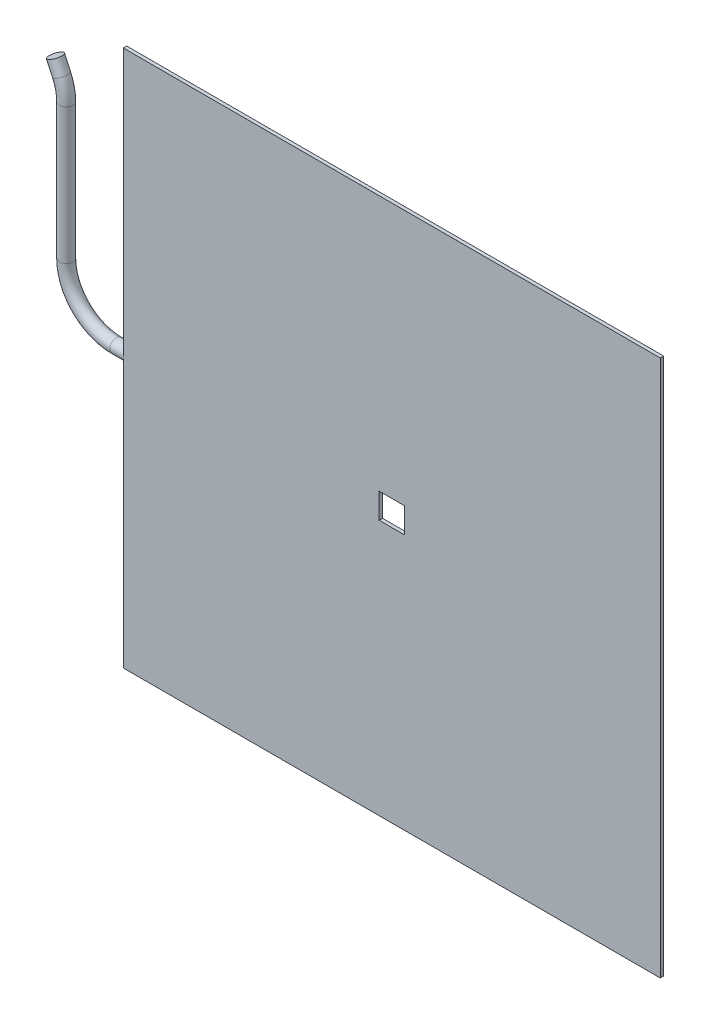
ISO-10303-21;
HEADER;
FILE_DESCRIPTION(('STEP AP214'),'2;1');
FILE_NAME('part.step','',(''),(''),'','','');
FILE_SCHEMA(('AUTOMOTIVE_DESIGN { 1 0 10303 214 1 1 1 1 }'));
ENDSEC;
DATA;
#1=APPLICATION_CONTEXT('core data for automotive mechanical design processes');
#2=APPLICATION_PROTOCOL_DEFINITION('international standard','automotive_design',2000,#1);
#3=PRODUCT_CONTEXT('',#1,'mechanical');
#4=PRODUCT('Part','Part','',(#3));
#5=PRODUCT_RELATED_PRODUCT_CATEGORY('part','',(#4));
#6=PRODUCT_DEFINITION_FORMATION('','',#4);
#7=PRODUCT_DEFINITION_CONTEXT('part definition',#1,'design');
#8=PRODUCT_DEFINITION('design','',#6,#7);
#9=PRODUCT_DEFINITION_SHAPE('','',#8);
#10=(LENGTH_UNIT() NAMED_UNIT(*) SI_UNIT(.MILLI.,.METRE.));
#11=(NAMED_UNIT(*) PLANE_ANGLE_UNIT() SI_UNIT($,.RADIAN.));
#12=(NAMED_UNIT(*) SI_UNIT($,.STERADIAN.) SOLID_ANGLE_UNIT());
#13=UNCERTAINTY_MEASURE_WITH_UNIT(LENGTH_MEASURE(1.E-05),#10,'distance_accuracy_value','');
#14=(GEOMETRIC_REPRESENTATION_CONTEXT(3) GLOBAL_UNCERTAINTY_ASSIGNED_CONTEXT((#13)) GLOBAL_UNIT_ASSIGNED_CONTEXT((#10,
#11,#12)) REPRESENTATION_CONTEXT('',''));
#15=CARTESIAN_POINT('',(0.,0.,0.));
#16=DIRECTION('',(0.,0.,1.));
#17=DIRECTION('',(1.,0.,0.));
#18=AXIS2_PLACEMENT_3D('',#15,#16,#17);
#19=CARTESIAN_POINT('',(-160.,-160.,1.5));
#20=DIRECTION('',(-0.707106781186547,0.,-0.707106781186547));
#21=DIRECTION('',(0.,1.,0.));
#22=AXIS2_PLACEMENT_3D('',#19,#20,#21);
#23=PLANE('',#22);
#24=DIRECTION('',(-0.707106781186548,0.,0.707106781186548));
#25=VECTOR('',#24,1.);
#26=CARTESIAN_POINT('',(-160.,-25.,1.50000000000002));
#27=LINE('',#26,#25);
#28=CARTESIAN_POINT('',(-158.5,-25.,0.));
#29=VERTEX_POINT('',#28);
#30=CARTESIAN_POINT('',(-160.,-25.,1.5));
#31=VERTEX_POINT('',#30);
#32=EDGE_CURVE('E323',#29,#31,#27,.T.);
#33=ORIENTED_EDGE('',*,*,#32,.F.);
#34=DIRECTION('',(0.,1.,0.));
#35=VECTOR('',#34,1.);
#36=CARTESIAN_POINT('',(-158.5,160.,0.));
#37=LINE('',#36,#35);
#38=CARTESIAN_POINT('',(-158.5,-158.5,0.));
#39=VERTEX_POINT('',#38);
#40=EDGE_CURVE('E280',#39,#29,#37,.T.);
#41=ORIENTED_EDGE('',*,*,#40,.F.);
#42=DIRECTION('',(0.577350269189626,0.577350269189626,-0.577350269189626));
#43=VECTOR('',#42,1.);
#44=CARTESIAN_POINT('',(-160.,-160.,1.5));
#45=LINE('',#44,#43);
#46=CARTESIAN_POINT('',(-160.,-160.,1.5));
#47=VERTEX_POINT('',#46);
#48=EDGE_CURVE('E309',#39,#47,#45,.F.);
#49=ORIENTED_EDGE('',*,*,#48,.T.);
#50=DIRECTION('',(0.,-1.,0.));
#51=VECTOR('',#50,1.);
#52=CARTESIAN_POINT('',(-160.,-160.,1.5));
#53=LINE('',#52,#51);
#54=EDGE_CURVE('E286',#31,#47,#53,.T.);
#55=ORIENTED_EDGE('',*,*,#54,.F.);
#56=EDGE_LOOP('',(#33,#41,#49,#55));
#57=FACE_BOUND('',#56,.T.);
#58=ADVANCED_FACE('F38',(#57),#23,.T.);
#59=CARTESIAN_POINT('',(160.,-160.,3.5));
#60=DIRECTION('',(-1.,0.,0.));
#61=DIRECTION('',(0.,0.,1.));
#62=AXIS2_PLACEMENT_3D('',#59,#60,#61);
#63=PLANE('',#62);
#64=DIRECTION('',(0.,0.,-1.));
#65=VECTOR('',#64,1.);
#66=CARTESIAN_POINT('',(160.,-160.,3.5));
#67=LINE('',#66,#65);
#68=CARTESIAN_POINT('',(160.,-160.,3.5));
#69=VERTEX_POINT('',#68);
#70=CARTESIAN_POINT('',(160.,-160.,1.5));
#71=VERTEX_POINT('',#70);
#72=EDGE_CURVE('E251',#69,#71,#67,.T.);
#73=ORIENTED_EDGE('',*,*,#72,.T.);
#74=DIRECTION('',(0.,1.,0.));
#75=VECTOR('',#74,1.);
#76=CARTESIAN_POINT('',(160.,160.,1.5));
#77=LINE('',#76,#75);
#78=CARTESIAN_POINT('',(160.,160.,1.5));
#79=VERTEX_POINT('',#78);
#80=EDGE_CURVE('E292',#71,#79,#77,.T.);
#81=ORIENTED_EDGE('',*,*,#80,.T.);
#82=DIRECTION('',(0.,0.,-1.));
#83=VECTOR('',#82,1.);
#84=CARTESIAN_POINT('',(160.,160.,3.5));
#85=LINE('',#84,#83);
#86=CARTESIAN_POINT('',(160.,160.,3.5));
#87=VERTEX_POINT('',#86);
#88=EDGE_CURVE('E260',#87,#79,#85,.T.);
#89=ORIENTED_EDGE('',*,*,#88,.F.);
#90=DIRECTION('',(0.,1.,0.));
#91=VECTOR('',#90,1.);
#92=CARTESIAN_POINT('',(160.,-160.,3.5));
#93=LINE('',#92,#91);
#94=EDGE_CURVE('E234',#69,#87,#93,.T.);
#95=ORIENTED_EDGE('',*,*,#94,.F.);
#96=EDGE_LOOP('',(#73,#81,#89,#95));
#97=FACE_BOUND('',#96,.T.);
#98=ADVANCED_FACE('F437',(#97),#63,.F.);
#99=CARTESIAN_POINT('',(-160.,160.,3.5));
#100=DIRECTION('',(0.,-1.,0.));
#101=DIRECTION('',(0.,0.,-1.));
#102=AXIS2_PLACEMENT_3D('',#99,#100,#101);
#103=PLANE('',#102);
#104=ORIENTED_EDGE('',*,*,#88,.T.);
#105=DIRECTION('',(-1.,0.,0.));
#106=VECTOR('',#105,1.);
#107=CARTESIAN_POINT('',(-160.,160.,1.5));
#108=LINE('',#107,#106);
#109=CARTESIAN_POINT('',(-160.,160.,1.5));
#110=VERTEX_POINT('',#109);
#111=EDGE_CURVE('E263',#79,#110,#108,.T.);
#112=ORIENTED_EDGE('',*,*,#111,.T.);
#113=DIRECTION('',(0.,0.,-1.));
#114=VECTOR('',#113,1.);
#115=CARTESIAN_POINT('',(-160.,160.,3.5));
#116=LINE('',#115,#114);
#117=CARTESIAN_POINT('',(-160.,160.,3.5));
#118=VERTEX_POINT('',#117);
#119=EDGE_CURVE('E257',#118,#110,#116,.T.);
#120=ORIENTED_EDGE('',*,*,#119,.F.);
#121=DIRECTION('',(-1.,0.,0.));
#122=VECTOR('',#121,1.);
#123=CARTESIAN_POINT('',(-160.,160.,3.5));
#124=LINE('',#123,#122);
#125=EDGE_CURVE('E245',#87,#118,#124,.T.);
#126=ORIENTED_EDGE('',*,*,#125,.F.);
#127=EDGE_LOOP('',(#104,#112,#120,#126));
#128=FACE_BOUND('',#127,.T.);
#129=ADVANCED_FACE('F387',(#128),#103,.F.);
#130=CARTESIAN_POINT('',(-160.,-160.,3.5));
#131=DIRECTION('',(1.,0.,0.));
#132=DIRECTION('',(0.,0.,-1.));
#133=AXIS2_PLACEMENT_3D('',#130,#131,#132);
#134=PLANE('',#133);
#135=DIRECTION('',(0.,1.,0.));
#136=VECTOR('',#135,1.);
#137=CARTESIAN_POINT('',(-160.,-25.,-5.));
#138=LINE('',#137,#136);
#139=CARTESIAN_POINT('',(-160.,0.,-5.));
#140=VERTEX_POINT('',#139);
#141=CARTESIAN_POINT('',(-160.,24.,-5.));
#142=VERTEX_POINT('',#141);
#143=EDGE_CURVE('E201',#140,#142,#138,.T.);
#144=ORIENTED_EDGE('',*,*,#143,.F.);
#145=CARTESIAN_POINT('',(-160.,0.,-1.));
#146=DIRECTION('',(1.,0.,0.));
#147=DIRECTION('',(0.,0.,-1.));
#148=AXIS2_PLACEMENT_3D('',#145,#146,#147);
#149=CIRCLE('',#148,4.);
#150=EDGE_CURVE('E53',#140,#140,#149,.T.);
#151=ORIENTED_EDGE('',*,*,#150,.T.);
#152=CARTESIAN_POINT('',(-160.,-24.0000000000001,-5.));
#153=VERTEX_POINT('',#152);
#154=EDGE_CURVE('E202',#153,#140,#138,.T.);
#155=ORIENTED_EDGE('',*,*,#154,.F.);
#156=DIRECTION('',(0.,0.707106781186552,-0.707106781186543));
#157=VECTOR('',#156,1.);
#158=CARTESIAN_POINT('',(-160.,-24.,-5.00000000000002));
#159=LINE('',#158,#157);
#160=CARTESIAN_POINT('',(-160.,-25.,-4.00000000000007));
#161=VERTEX_POINT('',#160);
#162=EDGE_CURVE('E334',#153,#161,#159,.F.);
#163=ORIENTED_EDGE('',*,*,#162,.T.);
#164=DIRECTION('',(0.,0.,-1.));
#165=VECTOR('',#164,1.);
#166=CARTESIAN_POINT('',(-160.,-25.,1.5));
#167=LINE('',#166,#165);
#168=EDGE_CURVE('E205',#31,#161,#167,.T.);
#169=ORIENTED_EDGE('',*,*,#168,.F.);
#170=ORIENTED_EDGE('',*,*,#54,.T.);
#171=DIRECTION('',(0.,0.,-1.));
#172=VECTOR('',#171,1.);
#173=CARTESIAN_POINT('',(-160.,-160.,3.5));
#174=LINE('',#173,#172);
#175=CARTESIAN_POINT('',(-160.,-160.,3.5));
#176=VERTEX_POINT('',#175);
#177=EDGE_CURVE('E254',#176,#47,#174,.T.);
#178=ORIENTED_EDGE('',*,*,#177,.F.);
#179=DIRECTION('',(0.,-1.,0.));
#180=VECTOR('',#179,1.);
#181=CARTESIAN_POINT('',(-160.,-160.,3.5));
#182=LINE('',#181,#180);
#183=EDGE_CURVE('E247',#118,#176,#182,.T.);
#184=ORIENTED_EDGE('',*,*,#183,.F.);
#185=ORIENTED_EDGE('',*,*,#119,.T.);
#186=CARTESIAN_POINT('',(-160.,25.,1.5));
#187=VERTEX_POINT('',#186);
#188=EDGE_CURVE('E287',#110,#187,#53,.T.);
#189=ORIENTED_EDGE('',*,*,#188,.T.);
#190=DIRECTION('',(0.,0.,-1.));
#191=VECTOR('',#190,1.);
#192=CARTESIAN_POINT('',(-160.,25.,1.5));
#193=LINE('',#192,#191);
#194=CARTESIAN_POINT('',(-160.,25.,-4.00000000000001));
#195=VERTEX_POINT('',#194);
#196=EDGE_CURVE('E206',#187,#195,#193,.T.);
#197=ORIENTED_EDGE('',*,*,#196,.T.);
#198=DIRECTION('',(0.,0.70710678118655,0.707106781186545));
#199=VECTOR('',#198,1.);
#200=CARTESIAN_POINT('',(-160.,24.,-4.99999999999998));
#201=LINE('',#200,#199);
#202=EDGE_CURVE('E331',#195,#142,#201,.F.);
#203=ORIENTED_EDGE('',*,*,#202,.T.);
#204=EDGE_LOOP('',(#144,#151,#155,#163,#169,#170,#178,#184,#185,#189,#197,#203));
#205=FACE_BOUND('',#204,.T.);
#206=ADVANCED_FACE('F377',(#205),#134,.F.);
#207=CARTESIAN_POINT('',(-160.,-160.,3.5));
#208=DIRECTION('',(0.,1.,0.));
#209=DIRECTION('',(0.,0.,1.));
#210=AXIS2_PLACEMENT_3D('',#207,#208,#209);
#211=PLANE('',#210);
#212=ORIENTED_EDGE('',*,*,#177,.T.);
#213=DIRECTION('',(1.,0.,0.));
#214=VECTOR('',#213,1.);
#215=CARTESIAN_POINT('',(160.,-160.,1.5));
#216=LINE('',#215,#214);
#217=EDGE_CURVE('E290',#47,#71,#216,.T.);
#218=ORIENTED_EDGE('',*,*,#217,.T.);
#219=ORIENTED_EDGE('',*,*,#72,.F.);
#220=DIRECTION('',(1.,0.,0.));
#221=VECTOR('',#220,1.);
#222=CARTESIAN_POINT('',(-160.,-160.,3.5));
#223=LINE('',#222,#221);
#224=EDGE_CURVE('E249',#176,#69,#223,.T.);
#225=ORIENTED_EDGE('',*,*,#224,.F.);
#226=EDGE_LOOP('',(#212,#218,#219,#225));
#227=FACE_BOUND('',#226,.T.);
#228=ADVANCED_FACE('F428',(#227),#211,.F.);
#229=CARTESIAN_POINT('',(0.,0.,3.5));
#230=DIRECTION('',(0.,0.,-1.));
#231=DIRECTION('',(-1.,0.,0.));
#232=AXIS2_PLACEMENT_3D('',#229,#230,#231);
#233=PLANE('',#232);
#234=DIRECTION('',(-1.,0.,0.));
#235=VECTOR('',#234,1.);
#236=CARTESIAN_POINT('',(7.5,-7.5,3.5));
#237=LINE('',#236,#235);
#238=CARTESIAN_POINT('',(7.5,-7.5,3.5));
#239=VERTEX_POINT('',#238);
#240=CARTESIAN_POINT('',(-7.5,-7.5,3.5));
#241=VERTEX_POINT('',#240);
#242=EDGE_CURVE('E227',#239,#241,#237,.T.);
#243=ORIENTED_EDGE('',*,*,#242,.T.);
#244=DIRECTION('',(0.,1.,0.));
#245=VECTOR('',#244,1.);
#246=CARTESIAN_POINT('',(-7.5,-7.5,3.5));
#247=LINE('',#246,#245);
#248=CARTESIAN_POINT('',(-7.5,7.5,3.5));
#249=VERTEX_POINT('',#248);
#250=EDGE_CURVE('E217',#241,#249,#247,.T.);
#251=ORIENTED_EDGE('',*,*,#250,.T.);
#252=DIRECTION('',(1.,0.,0.));
#253=VECTOR('',#252,1.);
#254=CARTESIAN_POINT('',(7.5,7.5,3.5));
#255=LINE('',#254,#253);
#256=CARTESIAN_POINT('',(7.5,7.5,3.5));
#257=VERTEX_POINT('',#256);
#258=EDGE_CURVE('E220',#249,#257,#255,.T.);
#259=ORIENTED_EDGE('',*,*,#258,.T.);
#260=DIRECTION('',(0.,-1.,0.));
#261=VECTOR('',#260,1.);
#262=CARTESIAN_POINT('',(7.5,-7.5,3.5));
#263=LINE('',#262,#261);
#264=EDGE_CURVE('E224',#257,#239,#263,.T.);
#265=ORIENTED_EDGE('',*,*,#264,.T.);
#266=EDGE_LOOP('',(#243,#251,#259,#265));
#267=FACE_BOUND('',#266,.T.);
#268=ORIENTED_EDGE('',*,*,#94,.T.);
#269=ORIENTED_EDGE('',*,*,#125,.T.);
#270=ORIENTED_EDGE('',*,*,#183,.T.);
#271=ORIENTED_EDGE('',*,*,#224,.T.);
#272=EDGE_LOOP('',(#268,#269,#270,#271));
#273=FACE_BOUND('',#272,.T.);
#274=ADVANCED_FACE('F440',(#267,#273),#233,.F.);
#275=CARTESIAN_POINT('',(0.,0.,0.));
#276=DIRECTION('',(0.,0.,-1.));
#277=DIRECTION('',(-1.,0.,0.));
#278=AXIS2_PLACEMENT_3D('',#275,#276,#277);
#279=PLANE('',#278);
#280=DIRECTION('',(0.990675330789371,0.136243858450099,0.));
#281=VECTOR('',#280,1.);
#282=CARTESIAN_POINT('',(-119.90443403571,-24.6948925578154,0.));
#283=LINE('',#282,#281);
#284=CARTESIAN_POINT('',(-122.122973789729,-25.,0.));
#285=VERTEX_POINT('',#284);
#286=CARTESIAN_POINT('',(-120.285172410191,-24.7472540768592,0.));
#287=VERTEX_POINT('',#286);
#288=EDGE_CURVE('E350',#285,#287,#283,.T.);
#289=ORIENTED_EDGE('',*,*,#288,.T.);
#290=DIRECTION('',(0.,1.,0.));
#291=VECTOR('',#290,1.);
#292=CARTESIAN_POINT('',(-120.285172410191,160.001,0.));
#293=LINE('',#292,#291);
#294=CARTESIAN_POINT('',(-120.285172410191,24.7472540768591,0.));
#295=VERTEX_POINT('',#294);
#296=EDGE_CURVE('E12',#287,#295,#293,.T.);
#297=ORIENTED_EDGE('',*,*,#296,.T.);
#298=DIRECTION('',(-0.990675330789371,0.136243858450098,0.));
#299=VECTOR('',#298,1.);
#300=CARTESIAN_POINT('',(-119.878278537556,24.6912954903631,0.));
#301=LINE('',#300,#299);
#302=CARTESIAN_POINT('',(-122.12297378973,25.,0.));
#303=VERTEX_POINT('',#302);
#304=EDGE_CURVE('E47',#295,#303,#301,.T.);
#305=ORIENTED_EDGE('',*,*,#304,.T.);
#306=DIRECTION('',(1.,0.,0.));
#307=VECTOR('',#306,1.);
#308=CARTESIAN_POINT('',(0.,25.,0.));
#309=LINE('',#308,#307);
#310=CARTESIAN_POINT('',(-158.5,25.,0.));
#311=VERTEX_POINT('',#310);
#312=EDGE_CURVE('E209',#311,#303,#309,.T.);
#313=ORIENTED_EDGE('',*,*,#312,.F.);
#314=CARTESIAN_POINT('',(-158.5,158.5,0.));
#315=VERTEX_POINT('',#314);
#316=EDGE_CURVE('E279',#311,#315,#37,.T.);
#317=ORIENTED_EDGE('',*,*,#316,.T.);
#318=DIRECTION('',(1.,0.,0.));
#319=VECTOR('',#318,1.);
#320=CARTESIAN_POINT('',(160.,158.5,0.));
#321=LINE('',#320,#319);
#322=CARTESIAN_POINT('',(158.5,158.5,0.));
#323=VERTEX_POINT('',#322);
#324=EDGE_CURVE('E283',#315,#323,#321,.T.);
#325=ORIENTED_EDGE('',*,*,#324,.T.);
#326=DIRECTION('',(0.,-1.,0.));
#327=VECTOR('',#326,1.);
#328=CARTESIAN_POINT('',(158.5,-160.,0.));
#329=LINE('',#328,#327);
#330=CARTESIAN_POINT('',(158.5,-158.5,0.));
#331=VERTEX_POINT('',#330);
#332=EDGE_CURVE('E275',#323,#331,#329,.T.);
#333=ORIENTED_EDGE('',*,*,#332,.T.);
#334=DIRECTION('',(-1.,0.,0.));
#335=VECTOR('',#334,1.);
#336=CARTESIAN_POINT('',(-160.,-158.5,0.));
#337=LINE('',#336,#335);
#338=EDGE_CURVE('E277',#331,#39,#337,.T.);
#339=ORIENTED_EDGE('',*,*,#338,.T.);
#340=ORIENTED_EDGE('',*,*,#40,.T.);
#341=DIRECTION('',(-1.,0.,0.));
#342=VECTOR('',#341,1.);
#343=CARTESIAN_POINT('',(0.,-25.,0.));
#344=LINE('',#343,#342);
#345=EDGE_CURVE('E214',#285,#29,#344,.T.);
#346=ORIENTED_EDGE('',*,*,#345,.F.);
#347=EDGE_LOOP('',(#289,#297,#305,#313,#317,#325,#333,#339,#340,#346));
#348=FACE_BOUND('',#347,.T.);
#349=DIRECTION('',(0.,1.,0.));
#350=VECTOR('',#349,1.);
#351=CARTESIAN_POINT('',(9.,7.5,0.));
#352=LINE('',#351,#350);
#353=CARTESIAN_POINT('',(9.,-9.,0.));
#354=VERTEX_POINT('',#353);
#355=CARTESIAN_POINT('',(9.,9.,0.));
#356=VERTEX_POINT('',#355);
#357=EDGE_CURVE('E270',#354,#356,#352,.T.);
#358=ORIENTED_EDGE('',*,*,#357,.T.);
#359=DIRECTION('',(-1.,0.,0.));
#360=VECTOR('',#359,1.);
#361=CARTESIAN_POINT('',(-7.5,9.,0.));
#362=LINE('',#361,#360);
#363=CARTESIAN_POINT('',(-9.,9.,0.));
#364=VERTEX_POINT('',#363);
#365=EDGE_CURVE('E272',#356,#364,#362,.T.);
#366=ORIENTED_EDGE('',*,*,#365,.T.);
#367=DIRECTION('',(0.,-1.,0.));
#368=VECTOR('',#367,1.);
#369=CARTESIAN_POINT('',(-9.,-7.5,0.));
#370=LINE('',#369,#368);
#371=CARTESIAN_POINT('',(-9.,-9.,0.));
#372=VERTEX_POINT('',#371);
#373=EDGE_CURVE('E266',#364,#372,#370,.T.);
#374=ORIENTED_EDGE('',*,*,#373,.T.);
#375=DIRECTION('',(1.,0.,0.));
#376=VECTOR('',#375,1.);
#377=CARTESIAN_POINT('',(7.5,-9.,0.));
#378=LINE('',#377,#376);
#379=EDGE_CURVE('E268',#372,#354,#378,.T.);
#380=ORIENTED_EDGE('',*,*,#379,.T.);
#381=EDGE_LOOP('',(#358,#366,#374,#380));
#382=FACE_BOUND('',#381,.T.);
#383=ADVANCED_FACE('F394',(#348,#382),#279,.T.);
#384=CARTESIAN_POINT('',(-7.5,-7.5,3.5));
#385=DIRECTION('',(-1.,0.,0.));
#386=DIRECTION('',(0.,0.,1.));
#387=AXIS2_PLACEMENT_3D('',#384,#385,#386);
#388=PLANE('',#387);
#389=DIRECTION('',(0.,0.,-1.));
#390=VECTOR('',#389,1.);
#391=CARTESIAN_POINT('',(-7.5,-7.5,3.5));
#392=LINE('',#391,#390);
#393=CARTESIAN_POINT('',(-7.5,-7.5,1.5));
#394=VERTEX_POINT('',#393);
#395=EDGE_CURVE('E231',#241,#394,#392,.T.);
#396=ORIENTED_EDGE('',*,*,#395,.T.);
#397=DIRECTION('',(0.,1.,0.));
#398=VECTOR('',#397,1.);
#399=CARTESIAN_POINT('',(-7.5,7.5,1.5));
#400=LINE('',#399,#398);
#401=CARTESIAN_POINT('',(-7.5,7.5,1.5));
#402=VERTEX_POINT('',#401);
#403=EDGE_CURVE('E301',#394,#402,#400,.T.);
#404=ORIENTED_EDGE('',*,*,#403,.T.);
#405=DIRECTION('',(0.,0.,-1.));
#406=VECTOR('',#405,1.);
#407=CARTESIAN_POINT('',(-7.5,7.5,3.5));
#408=LINE('',#407,#406);
#409=EDGE_CURVE('E230',#249,#402,#408,.T.);
#410=ORIENTED_EDGE('',*,*,#409,.F.);
#411=ORIENTED_EDGE('',*,*,#250,.F.);
#412=EDGE_LOOP('',(#396,#404,#410,#411));
#413=FACE_BOUND('',#412,.T.);
#414=ADVANCED_FACE('F448',(#413),#388,.F.);
#415=CARTESIAN_POINT('',(7.5,-7.5,3.5));
#416=DIRECTION('',(0.,-1.,0.));
#417=DIRECTION('',(0.,0.,-1.));
#418=AXIS2_PLACEMENT_3D('',#415,#416,#417);
#419=PLANE('',#418);
#420=DIRECTION('',(0.,0.,-1.));
#421=VECTOR('',#420,1.);
#422=CARTESIAN_POINT('',(7.5,-7.5,3.5));
#423=LINE('',#422,#421);
#424=CARTESIAN_POINT('',(7.5,-7.5,1.5));
#425=VERTEX_POINT('',#424);
#426=EDGE_CURVE('E235',#239,#425,#423,.T.);
#427=ORIENTED_EDGE('',*,*,#426,.T.);
#428=DIRECTION('',(-1.,0.,0.));
#429=VECTOR('',#428,1.);
#430=CARTESIAN_POINT('',(-7.5,-7.5,1.5));
#431=LINE('',#430,#429);
#432=EDGE_CURVE('E299',#425,#394,#431,.T.);
#433=ORIENTED_EDGE('',*,*,#432,.T.);
#434=ORIENTED_EDGE('',*,*,#395,.F.);
#435=ORIENTED_EDGE('',*,*,#242,.F.);
#436=EDGE_LOOP('',(#427,#433,#434,#435));
#437=FACE_BOUND('',#436,.T.);
#438=ADVANCED_FACE('F512',(#437),#419,.F.);
#439=CARTESIAN_POINT('',(7.5,-7.5,3.5));
#440=DIRECTION('',(1.,0.,0.));
#441=DIRECTION('',(0.,0.,-1.));
#442=AXIS2_PLACEMENT_3D('',#439,#440,#441);
#443=PLANE('',#442);
#444=DIRECTION('',(0.,0.,-1.));
#445=VECTOR('',#444,1.);
#446=CARTESIAN_POINT('',(7.5,7.5,3.5));
#447=LINE('',#446,#445);
#448=CARTESIAN_POINT('',(7.5,7.5,1.5));
#449=VERTEX_POINT('',#448);
#450=EDGE_CURVE('E238',#257,#449,#447,.T.);
#451=ORIENTED_EDGE('',*,*,#450,.T.);
#452=DIRECTION('',(0.,-1.,0.));
#453=VECTOR('',#452,1.);
#454=CARTESIAN_POINT('',(7.5,-7.5,1.5));
#455=LINE('',#454,#453);
#456=EDGE_CURVE('E297',#449,#425,#455,.T.);
#457=ORIENTED_EDGE('',*,*,#456,.T.);
#458=ORIENTED_EDGE('',*,*,#426,.F.);
#459=ORIENTED_EDGE('',*,*,#264,.F.);
#460=EDGE_LOOP('',(#451,#457,#458,#459));
#461=FACE_BOUND('',#460,.T.);
#462=ADVANCED_FACE('F515',(#461),#443,.F.);
#463=CARTESIAN_POINT('',(7.5,7.5,3.5));
#464=DIRECTION('',(0.,1.,0.));
#465=DIRECTION('',(0.,0.,1.));
#466=AXIS2_PLACEMENT_3D('',#463,#464,#465);
#467=PLANE('',#466);
#468=ORIENTED_EDGE('',*,*,#409,.T.);
#469=DIRECTION('',(1.,0.,0.));
#470=VECTOR('',#469,1.);
#471=CARTESIAN_POINT('',(7.5,7.5,1.5));
#472=LINE('',#471,#470);
#473=EDGE_CURVE('E294',#402,#449,#472,.T.);
#474=ORIENTED_EDGE('',*,*,#473,.T.);
#475=ORIENTED_EDGE('',*,*,#450,.F.);
#476=ORIENTED_EDGE('',*,*,#258,.F.);
#477=EDGE_LOOP('',(#468,#474,#475,#476));
#478=FACE_BOUND('',#477,.T.);
#479=ADVANCED_FACE('F469',(#478),#467,.F.);
#480=CARTESIAN_POINT('',(-160.,-160.,1.5));
#481=DIRECTION('',(0.,-0.707106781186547,-0.707106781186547));
#482=DIRECTION('',(-1.,0.,0.));
#483=AXIS2_PLACEMENT_3D('',#480,#481,#482);
#484=PLANE('',#483);
#485=ORIENTED_EDGE('',*,*,#48,.F.);
#486=ORIENTED_EDGE('',*,*,#338,.F.);
#487=DIRECTION('',(-0.577350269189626,0.577350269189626,-0.577350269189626));
#488=VECTOR('',#487,1.);
#489=CARTESIAN_POINT('',(160.,-160.,1.5));
#490=LINE('',#489,#488);
#491=EDGE_CURVE('E221',#71,#331,#490,.T.);
#492=ORIENTED_EDGE('',*,*,#491,.F.);
#493=ORIENTED_EDGE('',*,*,#217,.F.);
#494=EDGE_LOOP('',(#485,#486,#492,#493));
#495=FACE_BOUND('',#494,.T.);
#496=ADVANCED_FACE('F432',(#495),#484,.T.);
#497=CARTESIAN_POINT('',(160.,-160.,1.5));
#498=DIRECTION('',(0.707106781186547,0.,-0.707106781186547));
#499=DIRECTION('',(0.,-1.,0.));
#500=AXIS2_PLACEMENT_3D('',#497,#498,#499);
#501=PLANE('',#500);
#502=ORIENTED_EDGE('',*,*,#491,.T.);
#503=ORIENTED_EDGE('',*,*,#332,.F.);
#504=DIRECTION('',(0.577350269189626,0.577350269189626,0.577350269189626));
#505=VECTOR('',#504,1.);
#506=CARTESIAN_POINT('',(53.3333333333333,53.3333333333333,-105.166666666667));
#507=LINE('',#506,#505);
#508=EDGE_CURVE('E306',#79,#323,#507,.F.);
#509=ORIENTED_EDGE('',*,*,#508,.F.);
#510=ORIENTED_EDGE('',*,*,#80,.F.);
#511=EDGE_LOOP('',(#502,#503,#509,#510));
#512=FACE_BOUND('',#511,.T.);
#513=ADVANCED_FACE('F435',(#512),#501,.T.);
#514=DIRECTION('',(0.707106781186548,0.,-0.707106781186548));
#515=VECTOR('',#514,1.);
#516=CARTESIAN_POINT('',(-160.,25.,1.50000000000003));
#517=LINE('',#516,#515);
#518=EDGE_CURVE('E303',#187,#311,#517,.T.);
#519=ORIENTED_EDGE('',*,*,#518,.F.);
#520=ORIENTED_EDGE('',*,*,#188,.F.);
#521=DIRECTION('',(0.577350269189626,-0.577350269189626,-0.577350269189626));
#522=VECTOR('',#521,1.);
#523=CARTESIAN_POINT('',(-53.3333333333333,53.3333333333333,-105.166666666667));
#524=LINE('',#523,#522);
#525=EDGE_CURVE('E304',#315,#110,#524,.F.);
#526=ORIENTED_EDGE('',*,*,#525,.F.);
#527=ORIENTED_EDGE('',*,*,#316,.F.);
#528=EDGE_LOOP('',(#519,#520,#526,#527));
#529=FACE_BOUND('',#528,.T.);
#530=ADVANCED_FACE('F383',(#529),#23,.T.);
#531=CARTESIAN_POINT('',(-160.,160.,1.5));
#532=DIRECTION('',(0.,0.707106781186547,-0.707106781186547));
#533=DIRECTION('',(1.,0.,0.));
#534=AXIS2_PLACEMENT_3D('',#531,#532,#533);
#535=PLANE('',#534);
#536=ORIENTED_EDGE('',*,*,#508,.T.);
#537=ORIENTED_EDGE('',*,*,#324,.F.);
#538=ORIENTED_EDGE('',*,*,#525,.T.);
#539=ORIENTED_EDGE('',*,*,#111,.F.);
#540=EDGE_LOOP('',(#536,#537,#538,#539));
#541=FACE_BOUND('',#540,.T.);
#542=ADVANCED_FACE('F391',(#541),#535,.T.);
#543=CARTESIAN_POINT('',(7.5,-7.5,1.5));
#544=DIRECTION('',(0.,0.707106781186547,-0.707106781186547));
#545=DIRECTION('',(1.,0.,0.));
#546=AXIS2_PLACEMENT_3D('',#543,#544,#545);
#547=PLANE('',#546);
#548=DIRECTION('',(0.577350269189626,-0.577350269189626,-0.577350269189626));
#549=VECTOR('',#548,1.);
#550=CARTESIAN_POINT('',(7.5,-7.5,1.5));
#551=LINE('',#550,#549);
#552=EDGE_CURVE('E317',#354,#425,#551,.F.);
#553=ORIENTED_EDGE('',*,*,#552,.F.);
#554=ORIENTED_EDGE('',*,*,#379,.F.);
#555=DIRECTION('',(-0.577350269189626,-0.577350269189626,-0.577350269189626));
#556=VECTOR('',#555,1.);
#557=CARTESIAN_POINT('',(-2.5,-2.5,6.5));
#558=LINE('',#557,#556);
#559=EDGE_CURVE('E307',#394,#372,#558,.T.);
#560=ORIENTED_EDGE('',*,*,#559,.F.);
#561=ORIENTED_EDGE('',*,*,#432,.F.);
#562=EDGE_LOOP('',(#553,#554,#560,#561));
#563=FACE_BOUND('',#562,.T.);
#564=ADVANCED_FACE('F465',(#563),#547,.T.);
#565=CARTESIAN_POINT('',(-7.5,-7.5,1.5));
#566=DIRECTION('',(0.707106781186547,0.,-0.707106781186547));
#567=DIRECTION('',(0.,-1.,0.));
#568=AXIS2_PLACEMENT_3D('',#565,#566,#567);
#569=PLANE('',#568);
#570=ORIENTED_EDGE('',*,*,#559,.T.);
#571=ORIENTED_EDGE('',*,*,#373,.F.);
#572=DIRECTION('',(0.577350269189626,-0.577350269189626,0.577350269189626));
#573=VECTOR('',#572,1.);
#574=CARTESIAN_POINT('',(-2.5,2.5,6.5));
#575=LINE('',#574,#573);
#576=EDGE_CURVE('E315',#402,#364,#575,.F.);
#577=ORIENTED_EDGE('',*,*,#576,.F.);
#578=ORIENTED_EDGE('',*,*,#403,.F.);
#579=EDGE_LOOP('',(#570,#571,#577,#578));
#580=FACE_BOUND('',#579,.T.);
#581=ADVANCED_FACE('F479',(#580),#569,.T.);
#582=CARTESIAN_POINT('',(7.5,-7.5,1.5));
#583=DIRECTION('',(-0.707106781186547,0.,-0.707106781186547));
#584=DIRECTION('',(0.,1.,0.));
#585=AXIS2_PLACEMENT_3D('',#582,#583,#584);
#586=PLANE('',#585);
#587=ORIENTED_EDGE('',*,*,#552,.T.);
#588=ORIENTED_EDGE('',*,*,#456,.F.);
#589=DIRECTION('',(0.577350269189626,0.577350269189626,-0.577350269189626));
#590=VECTOR('',#589,1.);
#591=CARTESIAN_POINT('',(7.5,7.5,1.5));
#592=LINE('',#591,#590);
#593=EDGE_CURVE('E216',#356,#449,#592,.F.);
#594=ORIENTED_EDGE('',*,*,#593,.F.);
#595=ORIENTED_EDGE('',*,*,#357,.F.);
#596=EDGE_LOOP('',(#587,#588,#594,#595));
#597=FACE_BOUND('',#596,.T.);
#598=ADVANCED_FACE('F475',(#597),#586,.T.);
#599=CARTESIAN_POINT('',(7.5,7.5,1.5));
#600=DIRECTION('',(0.,-0.707106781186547,-0.707106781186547));
#601=DIRECTION('',(-1.,0.,0.));
#602=AXIS2_PLACEMENT_3D('',#599,#600,#601);
#603=PLANE('',#602);
#604=ORIENTED_EDGE('',*,*,#576,.T.);
#605=ORIENTED_EDGE('',*,*,#365,.F.);
#606=ORIENTED_EDGE('',*,*,#593,.T.);
#607=ORIENTED_EDGE('',*,*,#473,.F.);
#608=EDGE_LOOP('',(#604,#605,#606,#607));
#609=FACE_BOUND('',#608,.T.);
#610=ADVANCED_FACE('F472',(#609),#603,.T.);
#611=CARTESIAN_POINT('',(-120.,-25.,1.5));
#612=DIRECTION('',(0.,-1.,0.));
#613=DIRECTION('',(1.,0.,0.));
#614=AXIS2_PLACEMENT_3D('',#611,#612,#613);
#615=PLANE('',#614);
#616=ORIENTED_EDGE('',*,*,#168,.T.);
#617=DIRECTION('',(1.,0.,0.));
#618=VECTOR('',#617,1.);
#619=CARTESIAN_POINT('',(-120.,-25.,-4.00000000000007));
#620=LINE('',#619,#618);
#621=CARTESIAN_POINT('',(-150.931965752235,-25.,-4.00000000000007));
#622=VERTEX_POINT('',#621);
#623=EDGE_CURVE('E338',#161,#622,#620,.T.);
#624=ORIENTED_EDGE('',*,*,#623,.T.);
#625=DIRECTION('',(0.990498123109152,0.,0.137526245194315));
#626=VECTOR('',#625,1.);
#627=CARTESIAN_POINT('',(-120.137526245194,-25.,0.275670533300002));
#628=LINE('',#627,#626);
#629=EDGE_CURVE('E336',#622,#285,#628,.T.);
#630=ORIENTED_EDGE('',*,*,#629,.T.);
#631=ORIENTED_EDGE('',*,*,#345,.T.);
#632=ORIENTED_EDGE('',*,*,#32,.T.);
#633=EDGE_LOOP('',(#616,#624,#630,#631,#632));
#634=FACE_BOUND('',#633,.T.);
#635=ADVANCED_FACE('F417',(#634),#615,.T.);
#636=CARTESIAN_POINT('',(-120.,25.,1.5));
#637=DIRECTION('',(0.,1.,0.));
#638=DIRECTION('',(-1.,0.,0.));
#639=AXIS2_PLACEMENT_3D('',#636,#637,#638);
#640=PLANE('',#639);
#641=DIRECTION('',(-0.990498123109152,0.,-0.137526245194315));
#642=VECTOR('',#641,1.);
#643=CARTESIAN_POINT('',(-151.00040062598,25.,-4.00950187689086));
#644=LINE('',#643,#642);
#645=CARTESIAN_POINT('',(-150.931965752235,25.,-4.00000000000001));
#646=VERTEX_POINT('',#645);
#647=EDGE_CURVE('E346',#303,#646,#644,.T.);
#648=ORIENTED_EDGE('',*,*,#647,.T.);
#649=DIRECTION('',(-1.,0.,0.));
#650=VECTOR('',#649,1.);
#651=CARTESIAN_POINT('',(-120.,25.,-4.00000000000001));
#652=LINE('',#651,#650);
#653=EDGE_CURVE('E348',#646,#195,#652,.T.);
#654=ORIENTED_EDGE('',*,*,#653,.T.);
#655=ORIENTED_EDGE('',*,*,#196,.F.);
#656=ORIENTED_EDGE('',*,*,#518,.T.);
#657=ORIENTED_EDGE('',*,*,#312,.T.);
#658=EDGE_LOOP('',(#648,#654,#655,#656,#657));
#659=FACE_BOUND('',#658,.T.);
#660=ADVANCED_FACE('F373',(#659),#640,.T.);
#661=CARTESIAN_POINT('',(0.,0.,-5.));
#662=DIRECTION('',(0.,0.,-1.));
#663=DIRECTION('',(-1.,0.,0.));
#664=AXIS2_PLACEMENT_3D('',#661,#662,#663);
#665=PLANE('',#664);
#666=DIRECTION('',(0.,-1.,0.));
#667=VECTOR('',#666,1.);
#668=CARTESIAN_POINT('',(-150.862874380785,160.001,-5.));
#669=LINE('',#668,#667);
#670=CARTESIAN_POINT('',(-150.862874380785,24.,-5.));
#671=VERTEX_POINT('',#670);
#672=CARTESIAN_POINT('',(-150.862874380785,-24.,-5.));
#673=VERTEX_POINT('',#672);
#674=EDGE_CURVE('E198',#671,#673,#669,.T.);
#675=ORIENTED_EDGE('',*,*,#674,.T.);
#676=DIRECTION('',(-1.,0.,0.));
#677=VECTOR('',#676,1.);
#678=CARTESIAN_POINT('',(0.,-24.,-5.));
#679=LINE('',#678,#677);
#680=EDGE_CURVE('E328',#673,#153,#679,.T.);
#681=ORIENTED_EDGE('',*,*,#680,.T.);
#682=ORIENTED_EDGE('',*,*,#154,.T.);
#683=ORIENTED_EDGE('',*,*,#143,.T.);
#684=DIRECTION('',(1.,0.,0.));
#685=VECTOR('',#684,1.);
#686=CARTESIAN_POINT('',(0.,24.,-5.));
#687=LINE('',#686,#685);
#688=EDGE_CURVE('E326',#142,#671,#687,.T.);
#689=ORIENTED_EDGE('',*,*,#688,.T.);
#690=EDGE_LOOP('',(#675,#681,#682,#683,#689));
#691=FACE_BOUND('',#690,.T.);
#692=ADVANCED_FACE('F406',(#691),#665,.T.);
#693=CARTESIAN_POINT('',(-120.,160.001,-0.714827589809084));
#694=DIRECTION('',(-0.137526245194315,0.,0.990498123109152));
#695=DIRECTION('',(0.990498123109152,0.,0.137526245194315));
#696=AXIS2_PLACEMENT_3D('',#693,#694,#695);
#697=PLANE('',#696);
#698=DIRECTION('',(0.,-1.,0.));
#699=VECTOR('',#698,1.);
#700=CARTESIAN_POINT('',(-121.161231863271,-25.,-0.876059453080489));
#701=LINE('',#700,#699);
#702=CARTESIAN_POINT('',(-121.161231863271,24.,-0.876059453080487));
#703=VERTEX_POINT('',#702);
#704=CARTESIAN_POINT('',(-121.161231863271,-24.,-0.876059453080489));
#705=VERTEX_POINT('',#704);
#706=EDGE_CURVE('E340',#703,#705,#701,.T.);
#707=ORIENTED_EDGE('',*,*,#706,.T.);
#708=DIRECTION('',(-0.990498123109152,0.,-0.137526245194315));
#709=VECTOR('',#708,1.);
#710=CARTESIAN_POINT('',(-150.862874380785,-24.0000000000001,-5.));
#711=LINE('',#710,#709);
#712=EDGE_CURVE('E344',#705,#673,#711,.T.);
#713=ORIENTED_EDGE('',*,*,#712,.T.);
#714=ORIENTED_EDGE('',*,*,#674,.F.);
#715=DIRECTION('',(0.990498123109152,0.,0.137526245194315));
#716=VECTOR('',#715,1.);
#717=CARTESIAN_POINT('',(-120.,24.,-0.714827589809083));
#718=LINE('',#717,#716);
#719=EDGE_CURVE('E342',#671,#703,#718,.T.);
#720=ORIENTED_EDGE('',*,*,#719,.T.);
#721=EDGE_LOOP('',(#707,#713,#714,#720));
#722=FACE_BOUND('',#721,.T.);
#723=ADVANCED_FACE('F402',(#722),#697,.F.);
#724=CARTESIAN_POINT('',(0.,24.,-5.));
#725=DIRECTION('',(0.,-0.707106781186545,0.70710678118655));
#726=DIRECTION('',(1.,0.,0.));
#727=AXIS2_PLACEMENT_3D('',#724,#725,#726);
#728=PLANE('',#727);
#729=ORIENTED_EDGE('',*,*,#202,.F.);
#730=ORIENTED_EDGE('',*,*,#653,.F.);
#731=DIRECTION('',(0.0487967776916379,-0.706264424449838,-0.706264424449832));
#732=VECTOR('',#731,1.);
#733=CARTESIAN_POINT('',(-151.006719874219,26.0819603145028,-2.91803968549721));
#734=LINE('',#733,#732);
#735=EDGE_CURVE('E42',#671,#646,#734,.F.);
#736=ORIENTED_EDGE('',*,*,#735,.F.);
#737=ORIENTED_EDGE('',*,*,#688,.F.);
#738=EDGE_LOOP('',(#729,#730,#736,#737));
#739=FACE_BOUND('',#738,.T.);
#740=ADVANCED_FACE('F40',(#739),#728,.F.);
#741=CARTESIAN_POINT('',(-119.835823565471,25.,0.317560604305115));
#742=DIRECTION('',(0.0972457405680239,0.707106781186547,-0.70038793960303));
#743=DIRECTION('',(0.990498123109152,0.,0.137526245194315));
#744=AXIS2_PLACEMENT_3D('',#741,#742,#743);
#745=PLANE('',#744);
#746=ORIENTED_EDGE('',*,*,#647,.F.);
#747=ORIENTED_EDGE('',*,*,#304,.F.);
#748=DIRECTION('',(0.605498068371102,0.516472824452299,0.605498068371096));
#749=VECTOR('',#748,1.);
#750=CARTESIAN_POINT('',(-78.6305506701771,60.2774750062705,41.6546217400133));
#751=LINE('',#750,#749);
#752=EDGE_CURVE('E357',#703,#295,#751,.T.);
#753=ORIENTED_EDGE('',*,*,#752,.F.);
#754=ORIENTED_EDGE('',*,*,#719,.F.);
#755=ORIENTED_EDGE('',*,*,#735,.T.);
#756=EDGE_LOOP('',(#746,#747,#753,#754,#755));
#757=FACE_BOUND('',#756,.T.);
#758=ADVANCED_FACE('F367',(#757),#745,.T.);
#759=CARTESIAN_POINT('',(-121.161231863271,160.001,-0.876059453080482));
#760=DIRECTION('',(0.707106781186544,0.,-0.707106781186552));
#761=DIRECTION('',(0.,1.,0.));
#762=AXIS2_PLACEMENT_3D('',#759,#760,#761);
#763=PLANE('',#762);
#764=ORIENTED_EDGE('',*,*,#752,.T.);
#765=ORIENTED_EDGE('',*,*,#296,.F.);
#766=DIRECTION('',(-0.605498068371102,0.516472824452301,-0.605498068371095));
#767=VECTOR('',#766,1.);
#768=CARTESIAN_POINT('',(-178.702631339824,25.081195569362,-58.4174589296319));
#769=LINE('',#768,#767);
#770=EDGE_CURVE('E355',#705,#287,#769,.F.);
#771=ORIENTED_EDGE('',*,*,#770,.F.);
#772=ORIENTED_EDGE('',*,*,#706,.F.);
#773=EDGE_LOOP('',(#764,#765,#771,#772));
#774=FACE_BOUND('',#773,.T.);
#775=ADVANCED_FACE('F399',(#774),#763,.T.);
#776=CARTESIAN_POINT('',(-120.,-24.,-0.714827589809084));
#777=DIRECTION('',(0.0972457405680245,-0.707106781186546,-0.700387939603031));
#778=DIRECTION('',(0.990498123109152,0.,0.137526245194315));
#779=AXIS2_PLACEMENT_3D('',#776,#777,#778);
#780=PLANE('',#779);
#781=ORIENTED_EDGE('',*,*,#288,.F.);
#782=ORIENTED_EDGE('',*,*,#629,.F.);
#783=DIRECTION('',(-0.0487967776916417,-0.706264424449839,0.70626442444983));
#784=VECTOR('',#783,1.);
#785=CARTESIAN_POINT('',(-150.937067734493,-25.0738439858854,-3.92615601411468));
#786=LINE('',#785,#784);
#787=EDGE_CURVE('E191',#673,#622,#786,.T.);
#788=ORIENTED_EDGE('',*,*,#787,.F.);
#789=ORIENTED_EDGE('',*,*,#712,.F.);
#790=ORIENTED_EDGE('',*,*,#770,.T.);
#791=EDGE_LOOP('',(#781,#782,#788,#789,#790));
#792=FACE_BOUND('',#791,.T.);
#793=ADVANCED_FACE('F412',(#792),#780,.T.);
#794=CARTESIAN_POINT('',(0.,-24.,-5.));
#795=DIRECTION('',(0.,0.707106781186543,0.707106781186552));
#796=DIRECTION('',(-1.,0.,0.));
#797=AXIS2_PLACEMENT_3D('',#794,#795,#796);
#798=PLANE('',#797);
#799=ORIENTED_EDGE('',*,*,#787,.T.);
#800=ORIENTED_EDGE('',*,*,#623,.F.);
#801=ORIENTED_EDGE('',*,*,#162,.F.);
#802=ORIENTED_EDGE('',*,*,#680,.F.);
#803=EDGE_LOOP('',(#799,#800,#801,#802));
#804=FACE_BOUND('',#803,.T.);
#805=ADVANCED_FACE('F415',(#804),#798,.F.);
#806=CARTESIAN_POINT('',(-165.,0.,-1.));
#807=DIRECTION('',(1.,0.,0.));
#808=DIRECTION('',(0.,0.,-1.));
#809=AXIS2_PLACEMENT_3D('',#806,#807,#808);
#810=CYLINDRICAL_SURFACE('',#809,4.);
#811=ORIENTED_EDGE('',*,*,#150,.F.);
#812=EDGE_LOOP('',(#811));
#813=FACE_BOUND('',#812,.T.);
#814=CARTESIAN_POINT('',(-168.534731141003,0.,-1.));
#815=DIRECTION('',(1.,0.,0.));
#816=DIRECTION('',(0.,0.,-1.));
#817=AXIS2_PLACEMENT_3D('',#814,#815,#816);
#818=CIRCLE('',#817,4.);
#819=CARTESIAN_POINT('',(-168.534731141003,-3.99999999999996,-1.));
#820=VERTEX_POINT('',#819);
#821=EDGE_CURVE('E730',#820,#820,#818,.T.);
#822=ORIENTED_EDGE('',*,*,#821,.T.);
#823=EDGE_LOOP('',(#822));
#824=FACE_BOUND('',#823,.T.);
#825=ADVANCED_FACE('F489',(#813,#824),#810,.T.);
#826=CARTESIAN_POINT('',(-204.938531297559,131.236493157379,-1.));
#827=DIRECTION('',(0.419635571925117,-0.907692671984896,0.));
#828=DIRECTION('',(0.,0.,-1.));
#829=AXIS2_PLACEMENT_3D('',#826,#827,#828);
#830=PLANE('',#829);
#831=CARTESIAN_POINT('',(-204.938531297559,131.236493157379,-1.));
#832=DIRECTION('',(0.419635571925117,-0.907692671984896,0.));
#833=DIRECTION('',(0.,0.,-1.));
#834=AXIS2_PLACEMENT_3D('',#831,#832,#833);
#835=CIRCLE('',#834,4.);
#836=CARTESIAN_POINT('',(-204.938531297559,131.236493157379,-5.));
#837=VERTEX_POINT('',#836);
#838=EDGE_CURVE('E185',#837,#837,#835,.T.);
#839=ORIENTED_EDGE('',*,*,#838,.F.);
#840=EDGE_LOOP('',(#839));
#841=FACE_BOUND('',#840,.T.);
#842=ADVANCED_FACE('F676',(#841),#830,.F.);
#843=CARTESIAN_POINT('',(-168.534731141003,30.,-1.));
#844=DIRECTION('',(0.,0.,-1.));
#845=DIRECTION('',(-1.,0.,0.));
#846=AXIS2_PLACEMENT_3D('',#843,#844,#845);
#847=TOROIDAL_SURFACE('',#846,30.,4.);
#848=CARTESIAN_POINT('',(-198.534731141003,30.,-1.));
#849=DIRECTION('',(0.,-1.,0.));
#850=DIRECTION('',(0.,0.,-1.));
#851=AXIS2_PLACEMENT_3D('',#848,#849,#850);
#852=CIRCLE('',#851,4.);
#853=CARTESIAN_POINT('',(-202.534731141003,30.,-1.));
#854=VERTEX_POINT('',#853);
#855=EDGE_CURVE('E728',#854,#854,#852,.T.);
#856=CARTESIAN_POINT('',(-168.534731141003,30.,-1.));
#857=DIRECTION('',(0.,0.,-1.));
#858=DIRECTION('',(-1.,0.,0.));
#859=AXIS2_PLACEMENT_3D('',#856,#857,#858);
#860=CIRCLE('',#859,34.);
#861=EDGE_CURVE('',#820,#854,#860,.T.);
#862=ORIENTED_EDGE('',*,*,#821,.F.);
#863=ORIENTED_EDGE('',*,*,#855,.T.);
#864=ORIENTED_EDGE('',*,*,#861,.T.);
#865=ORIENTED_EDGE('',*,*,#861,.F.);
#866=EDGE_LOOP('',(#862,#864,#863,#865));
#867=FACE_BOUND('',#866,.T.);
#868=ADVANCED_FACE('F684',(#867),#847,.T.);
#869=CARTESIAN_POINT('',(-198.534731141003,30.,-1.));
#870=DIRECTION('',(0.,1.,0.));
#871=DIRECTION('',(0.,0.,1.));
#872=AXIS2_PLACEMENT_3D('',#869,#870,#871);
#873=CYLINDRICAL_SURFACE('',#872,4.);
#874=CARTESIAN_POINT('',(-198.534731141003,110.785647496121,-1.));
#875=DIRECTION('',(0.,-1.,0.));
#876=DIRECTION('',(0.,0.,-1.));
#877=AXIS2_PLACEMENT_3D('',#874,#875,#876);
#878=CIRCLE('',#877,4.);
#879=CARTESIAN_POINT('',(-194.534731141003,110.785647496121,-1.));
#880=VERTEX_POINT('',#879);
#881=EDGE_CURVE('E194',#880,#880,#878,.T.);
#882=ORIENTED_EDGE('',*,*,#881,.T.);
#883=EDGE_LOOP('',(#882));
#884=FACE_BOUND('',#883,.T.);
#885=ORIENTED_EDGE('',*,*,#855,.F.);
#886=EDGE_LOOP('',(#885));
#887=FACE_BOUND('',#886,.T.);
#888=ADVANCED_FACE('F692',(#884,#887),#873,.T.);
#889=CARTESIAN_POINT('',(-228.534731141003,110.785647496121,-1.));
#890=DIRECTION('',(0.,0.,1.));
#891=DIRECTION('',(1.,0.,0.));
#892=AXIS2_PLACEMENT_3D('',#889,#890,#891);
#893=TOROIDAL_SURFACE('',#892,30.,4.);
#894=CARTESIAN_POINT('',(-201.303950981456,123.374714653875,-1.));
#895=DIRECTION('',(0.419635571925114,-0.907692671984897,0.));
#896=DIRECTION('',(0.,0.,-1.));
#897=AXIS2_PLACEMENT_3D('',#894,#895,#896);
#898=CIRCLE('',#897,4.);
#899=CARTESIAN_POINT('',(-197.673180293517,125.053256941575,-1.));
#900=VERTEX_POINT('',#899);
#901=EDGE_CURVE('E189',#900,#900,#898,.T.);
#902=CARTESIAN_POINT('',(-228.534731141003,110.785647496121,-1.));
#903=DIRECTION('',(0.,0.,1.));
#904=DIRECTION('',(1.,0.,0.));
#905=AXIS2_PLACEMENT_3D('',#902,#903,#904);
#906=CIRCLE('',#905,34.);
#907=EDGE_CURVE('',#880,#900,#906,.T.);
#908=ORIENTED_EDGE('',*,*,#881,.F.);
#909=ORIENTED_EDGE('',*,*,#901,.T.);
#910=ORIENTED_EDGE('',*,*,#907,.T.);
#911=ORIENTED_EDGE('',*,*,#907,.F.);
#912=EDGE_LOOP('',(#908,#910,#909,#911));
#913=FACE_BOUND('',#912,.T.);
#914=ADVANCED_FACE('F702',(#913),#893,.T.);
#915=CARTESIAN_POINT('',(-201.303950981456,123.374714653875,-1.));
#916=DIRECTION('',(-0.419635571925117,0.907692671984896,0.));
#917=DIRECTION('',(-0.907692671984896,-0.419635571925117,0.));
#918=AXIS2_PLACEMENT_3D('',#915,#916,#917);
#919=CYLINDRICAL_SURFACE('',#918,4.);
#920=ORIENTED_EDGE('',*,*,#838,.T.);
#921=EDGE_LOOP('',(#920));
#922=FACE_BOUND('',#921,.T.);
#923=ORIENTED_EDGE('',*,*,#901,.F.);
#924=EDGE_LOOP('',(#923));
#925=FACE_BOUND('',#924,.T.);
#926=ADVANCED_FACE('F186',(#922,#925),#919,.T.);
#927=CLOSED_SHELL('',(#58,#98,#129,#206,#228,#274,#383,#414,#438,#462,#479,#496,#513,#530,#542,
#564,#581,#598,#610,#635,#660,#692,#723,#740,#758,#775,#793,#805,#825,#842,#868,#888,#914,#926));
#928=MANIFOLD_SOLID_BREP('B2',#927);
#929=ADVANCED_BREP_SHAPE_REPRESENTATION('',(#18,#928),#14);
#930=SHAPE_DEFINITION_REPRESENTATION(#9,#929);
ENDSEC;
END-ISO-10303-21;
